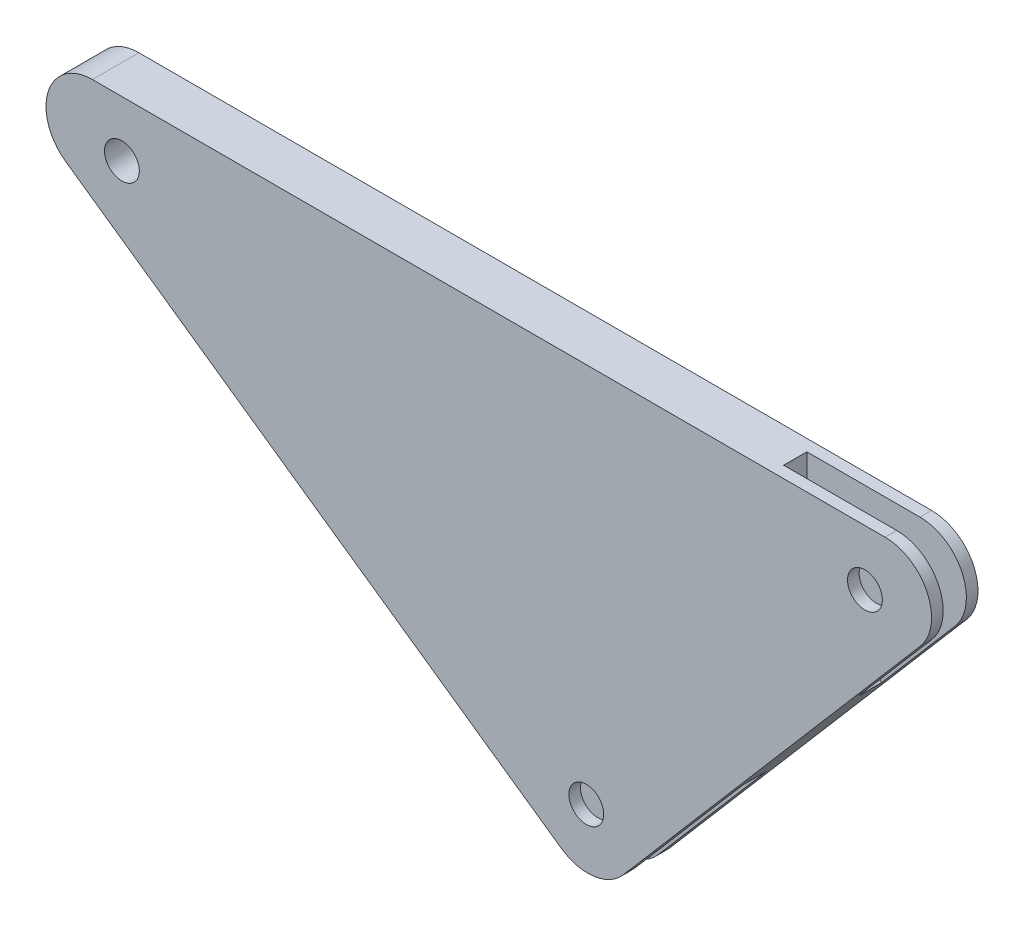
ISO-10303-21;
HEADER;
FILE_DESCRIPTION(('STEP AP214'),'2;1');
FILE_NAME('part.step','',(''),(''),'','','');
FILE_SCHEMA(('AUTOMOTIVE_DESIGN { 1 0 10303 214 1 1 1 1 }'));
ENDSEC;
DATA;
#1=APPLICATION_CONTEXT('core data for automotive mechanical design processes');
#2=APPLICATION_PROTOCOL_DEFINITION('international standard','automotive_design',2000,#1);
#3=PRODUCT_CONTEXT('',#1,'mechanical');
#4=PRODUCT('Part','Part','',(#3));
#5=PRODUCT_RELATED_PRODUCT_CATEGORY('part','',(#4));
#6=PRODUCT_DEFINITION_FORMATION('','',#4);
#7=PRODUCT_DEFINITION_CONTEXT('part definition',#1,'design');
#8=PRODUCT_DEFINITION('design','',#6,#7);
#9=PRODUCT_DEFINITION_SHAPE('','',#8);
#10=(LENGTH_UNIT() NAMED_UNIT(*) SI_UNIT(.MILLI.,.METRE.));
#11=(NAMED_UNIT(*) PLANE_ANGLE_UNIT() SI_UNIT($,.RADIAN.));
#12=(NAMED_UNIT(*) SI_UNIT($,.STERADIAN.) SOLID_ANGLE_UNIT());
#13=UNCERTAINTY_MEASURE_WITH_UNIT(LENGTH_MEASURE(1.E-05),#10,'distance_accuracy_value','');
#14=(GEOMETRIC_REPRESENTATION_CONTEXT(3) GLOBAL_UNCERTAINTY_ASSIGNED_CONTEXT((#13)) GLOBAL_UNIT_ASSIGNED_CONTEXT((#10,
#11,#12)) REPRESENTATION_CONTEXT('',''));
#15=CARTESIAN_POINT('',(0.,0.,0.));
#16=DIRECTION('',(0.,0.,1.));
#17=DIRECTION('',(1.,0.,0.));
#18=AXIS2_PLACEMENT_3D('',#15,#16,#17);
#19=CARTESIAN_POINT('',(417.445040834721,5.08,12.7));
#20=DIRECTION('',(0.,0.,-1.));
#21=DIRECTION('',(-1.,0.,0.));
#22=AXIS2_PLACEMENT_3D('',#19,#20,#21);
#23=CYLINDRICAL_SURFACE('',#22,25.4);
#24=CARTESIAN_POINT('',(417.445040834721,5.08,-6.35));
#25=DIRECTION('',(0.,0.,1.));
#26=DIRECTION('',(1.,0.,0.));
#27=AXIS2_PLACEMENT_3D('',#24,#25,#26);
#28=CIRCLE('',#27,25.4);
#29=CARTESIAN_POINT('',(436.7301585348,-11.4501008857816,-6.35));
#30=VERTEX_POINT('',#29);
#31=CARTESIAN_POINT('',(417.445040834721,30.48,-6.35));
#32=VERTEX_POINT('',#31);
#33=EDGE_CURVE('E157',#30,#32,#28,.T.);
#34=ORIENTED_EDGE('',*,*,#33,.F.);
#35=DIRECTION('',(0.,0.,-1.));
#36=VECTOR('',#35,1.);
#37=CARTESIAN_POINT('',(436.7301585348,-11.4501008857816,12.7));
#38=LINE('',#37,#36);
#39=CARTESIAN_POINT('',(436.7301585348,-11.4501008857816,-12.7));
#40=VERTEX_POINT('',#39);
#41=EDGE_CURVE('E249',#30,#40,#38,.T.);
#42=ORIENTED_EDGE('',*,*,#41,.T.);
#43=CARTESIAN_POINT('',(417.445040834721,5.08,-12.7));
#44=DIRECTION('',(0.,0.,1.));
#45=DIRECTION('',(-1.,0.,0.));
#46=AXIS2_PLACEMENT_3D('',#43,#44,#45);
#47=CIRCLE('',#46,25.4);
#48=CARTESIAN_POINT('',(417.445040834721,30.48,-12.7));
#49=VERTEX_POINT('',#48);
#50=EDGE_CURVE('E232',#40,#49,#47,.T.);
#51=ORIENTED_EDGE('',*,*,#50,.T.);
#52=DIRECTION('',(0.,0.,-1.));
#53=VECTOR('',#52,1.);
#54=CARTESIAN_POINT('',(417.445040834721,30.48,12.7));
#55=LINE('',#54,#53);
#56=EDGE_CURVE('E43',#32,#49,#55,.T.);
#57=ORIENTED_EDGE('',*,*,#56,.F.);
#58=EDGE_LOOP('',(#34,#42,#51,#57));
#59=FACE_BOUND('',#58,.T.);
#60=ADVANCED_FACE('F34',(#59),#23,.T.);
#61=CARTESIAN_POINT('',(417.445040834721,30.48,12.7));
#62=DIRECTION('',(0.,-1.,0.));
#63=DIRECTION('',(1.,0.,0.));
#64=AXIS2_PLACEMENT_3D('',#61,#62,#63);
#65=PLANE('',#64);
#66=DIRECTION('',(-1.,0.,0.));
#67=VECTOR('',#66,1.);
#68=CARTESIAN_POINT('',(417.445040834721,30.48,-6.35));
#69=LINE('',#68,#67);
#70=CARTESIAN_POINT('',(355.6,30.48,-6.35));
#71=VERTEX_POINT('',#70);
#72=EDGE_CURVE('E151',#32,#71,#69,.T.);
#73=ORIENTED_EDGE('',*,*,#72,.F.);
#74=ORIENTED_EDGE('',*,*,#56,.T.);
#75=DIRECTION('',(-1.,0.,0.));
#76=VECTOR('',#75,1.);
#77=CARTESIAN_POINT('',(417.445040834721,30.48,-12.7));
#78=LINE('',#77,#76);
#79=CARTESIAN_POINT('',(-16.1156146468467,30.4799999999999,-12.7));
#80=VERTEX_POINT('',#79);
#81=EDGE_CURVE('E252',#49,#80,#78,.T.);
#82=ORIENTED_EDGE('',*,*,#81,.T.);
#83=DIRECTION('',(0.,0.,-1.));
#84=VECTOR('',#83,1.);
#85=CARTESIAN_POINT('',(-16.1156146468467,30.4799999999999,12.7));
#86=LINE('',#85,#84);
#87=CARTESIAN_POINT('',(-16.1156146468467,30.4799999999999,12.7));
#88=VERTEX_POINT('',#87);
#89=EDGE_CURVE('E278',#88,#80,#86,.T.);
#90=ORIENTED_EDGE('',*,*,#89,.F.);
#91=DIRECTION('',(-1.,0.,0.));
#92=VECTOR('',#91,1.);
#93=CARTESIAN_POINT('',(417.445040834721,30.48,12.7));
#94=LINE('',#93,#92);
#95=CARTESIAN_POINT('',(417.445040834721,30.48,12.7));
#96=VERTEX_POINT('',#95);
#97=EDGE_CURVE('E238',#96,#88,#94,.T.);
#98=ORIENTED_EDGE('',*,*,#97,.F.);
#99=CARTESIAN_POINT('',(417.445040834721,30.48,6.35));
#100=VERTEX_POINT('',#99);
#101=EDGE_CURVE('E11',#96,#100,#55,.T.);
#102=ORIENTED_EDGE('',*,*,#101,.T.);
#103=DIRECTION('',(-1.,0.,0.));
#104=VECTOR('',#103,1.);
#105=CARTESIAN_POINT('',(417.445040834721,30.48,6.35));
#106=LINE('',#105,#104);
#107=CARTESIAN_POINT('',(355.6,30.48,6.35));
#108=VERTEX_POINT('',#107);
#109=EDGE_CURVE('E175',#100,#108,#106,.T.);
#110=ORIENTED_EDGE('',*,*,#109,.T.);
#111=DIRECTION('',(0.,0.,1.));
#112=VECTOR('',#111,1.);
#113=CARTESIAN_POINT('',(355.6,30.48,-6.35));
#114=LINE('',#113,#112);
#115=EDGE_CURVE('E166',#71,#108,#114,.T.);
#116=ORIENTED_EDGE('',*,*,#115,.F.);
#117=EDGE_LOOP('',(#73,#74,#82,#90,#98,#102,#110,#116));
#118=FACE_BOUND('',#117,.T.);
#119=ADVANCED_FACE('F174',(#118),#65,.F.);
#120=CARTESIAN_POINT('',(-30.6815581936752,-15.7284907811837,12.7));
#121=DIRECTION('',(0.573462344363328,0.81923192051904,0.));
#122=DIRECTION('',(-0.81923192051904,0.573462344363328,0.));
#123=AXIS2_PLACEMENT_3D('',#120,#121,#122);
#124=PLANE('',#123);
#125=DIRECTION('',(0.81923192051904,-0.573462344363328,0.));
#126=VECTOR('',#125,1.);
#127=CARTESIAN_POINT('',(-30.6815581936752,-15.7284907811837,-6.35));
#128=LINE('',#127,#126);
#129=CARTESIAN_POINT('',(135.528296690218,-132.075389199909,-6.35));
#130=VERTEX_POINT('',#129);
#131=CARTESIAN_POINT('',(240.293851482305,-205.41127755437,-6.35));
#132=VERTEX_POINT('',#131);
#133=EDGE_CURVE('E207',#130,#132,#128,.T.);
#134=ORIENTED_EDGE('',*,*,#133,.F.);
#135=DIRECTION('',(0.,0.,1.));
#136=VECTOR('',#135,1.);
#137=CARTESIAN_POINT('',(135.528296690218,-132.075389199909,-6.35));
#138=LINE('',#137,#136);
#139=CARTESIAN_POINT('',(135.528296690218,-132.075389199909,6.35));
#140=VERTEX_POINT('',#139);
#141=EDGE_CURVE('E187',#130,#140,#138,.T.);
#142=ORIENTED_EDGE('',*,*,#141,.T.);
#143=DIRECTION('',(0.81923192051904,-0.573462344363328,0.));
#144=VECTOR('',#143,1.);
#145=CARTESIAN_POINT('',(-30.6815581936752,-15.7284907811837,6.35));
#146=LINE('',#145,#144);
#147=CARTESIAN_POINT('',(240.293851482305,-205.41127755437,6.35));
#148=VERTEX_POINT('',#147);
#149=EDGE_CURVE('E199',#140,#148,#146,.T.);
#150=ORIENTED_EDGE('',*,*,#149,.T.);
#151=DIRECTION('',(0.,0.,-1.));
#152=VECTOR('',#151,1.);
#153=CARTESIAN_POINT('',(240.293851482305,-205.41127755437,12.7));
#154=LINE('',#153,#152);
#155=CARTESIAN_POINT('',(240.293851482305,-205.41127755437,12.7));
#156=VERTEX_POINT('',#155);
#157=EDGE_CURVE('E272',#156,#148,#154,.T.);
#158=ORIENTED_EDGE('',*,*,#157,.F.);
#159=DIRECTION('',(0.81923192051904,-0.573462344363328,0.));
#160=VECTOR('',#159,1.);
#161=CARTESIAN_POINT('',(-30.6815581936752,-15.7284907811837,12.7));
#162=LINE('',#161,#160);
#163=CARTESIAN_POINT('',(-30.6815581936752,-15.7284907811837,12.7));
#164=VERTEX_POINT('',#163);
#165=EDGE_CURVE('E243',#164,#156,#162,.T.);
#166=ORIENTED_EDGE('',*,*,#165,.F.);
#167=DIRECTION('',(0.,0.,-1.));
#168=VECTOR('',#167,1.);
#169=CARTESIAN_POINT('',(-30.6815581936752,-15.7284907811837,12.7));
#170=LINE('',#169,#168);
#171=CARTESIAN_POINT('',(-30.6815581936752,-15.7284907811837,-12.7));
#172=VERTEX_POINT('',#171);
#173=EDGE_CURVE('E275',#164,#172,#170,.T.);
#174=ORIENTED_EDGE('',*,*,#173,.T.);
#175=DIRECTION('',(0.81923192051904,-0.573462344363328,0.));
#176=VECTOR('',#175,1.);
#177=CARTESIAN_POINT('',(-30.6815581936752,-15.7284907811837,-12.7));
#178=LINE('',#177,#176);
#179=CARTESIAN_POINT('',(240.293851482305,-205.41127755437,-12.7));
#180=VERTEX_POINT('',#179);
#181=EDGE_CURVE('E256',#172,#180,#178,.T.);
#182=ORIENTED_EDGE('',*,*,#181,.T.);
#183=EDGE_CURVE('E271',#132,#180,#154,.T.);
#184=ORIENTED_EDGE('',*,*,#183,.F.);
#185=EDGE_LOOP('',(#134,#142,#150,#158,#166,#174,#182,#184));
#186=FACE_BOUND('',#185,.T.);
#187=ADVANCED_FACE('F327',(#186),#124,.F.);
#188=CARTESIAN_POINT('',(254.859795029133,-184.602786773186,12.7));
#189=DIRECTION('',(0.,0.,-1.));
#190=DIRECTION('',(-1.,0.,0.));
#191=AXIS2_PLACEMENT_3D('',#188,#189,#190);
#192=CYLINDRICAL_SURFACE('',#191,25.4);
#193=CARTESIAN_POINT('',(254.859795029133,-184.602786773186,-6.35));
#194=DIRECTION('',(0.,0.,1.));
#195=DIRECTION('',(1.,0.,0.));
#196=AXIS2_PLACEMENT_3D('',#193,#194,#195);
#197=CIRCLE('',#196,25.4);
#198=CARTESIAN_POINT('',(274.144912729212,-201.132887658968,-6.35));
#199=VERTEX_POINT('',#198);
#200=EDGE_CURVE('E205',#132,#199,#197,.T.);
#201=ORIENTED_EDGE('',*,*,#200,.F.);
#202=ORIENTED_EDGE('',*,*,#183,.T.);
#203=CARTESIAN_POINT('',(254.859795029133,-184.602786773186,-12.7));
#204=DIRECTION('',(0.,0.,1.));
#205=DIRECTION('',(1.,0.,0.));
#206=AXIS2_PLACEMENT_3D('',#203,#204,#205);
#207=CIRCLE('',#206,25.4);
#208=CARTESIAN_POINT('',(274.144912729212,-201.132887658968,-12.7));
#209=VERTEX_POINT('',#208);
#210=EDGE_CURVE('E259',#180,#209,#207,.T.);
#211=ORIENTED_EDGE('',*,*,#210,.T.);
#212=DIRECTION('',(0.,0.,-1.));
#213=VECTOR('',#212,1.);
#214=CARTESIAN_POINT('',(274.144912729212,-201.132887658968,12.7));
#215=LINE('',#214,#213);
#216=EDGE_CURVE('E267',#199,#209,#215,.T.);
#217=ORIENTED_EDGE('',*,*,#216,.F.);
#218=EDGE_LOOP('',(#201,#202,#211,#217));
#219=FACE_BOUND('',#218,.T.);
#220=ADVANCED_FACE('F394',(#219),#192,.T.);
#221=CARTESIAN_POINT('',(274.144912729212,-201.132887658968,12.7));
#222=DIRECTION('',(-0.759256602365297,0.650791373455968,0.));
#223=DIRECTION('',(-0.650791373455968,-0.759256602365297,0.));
#224=AXIS2_PLACEMENT_3D('',#221,#222,#223);
#225=PLANE('',#224);
#226=DIRECTION('',(0.650791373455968,0.759256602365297,0.));
#227=VECTOR('',#226,1.);
#228=CARTESIAN_POINT('',(274.144912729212,-201.132887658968,-6.35));
#229=LINE('',#228,#227);
#230=CARTESIAN_POINT('',(396.481939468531,-58.406356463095,-6.35));
#231=VERTEX_POINT('',#230);
#232=EDGE_CURVE('E214',#231,#30,#229,.T.);
#233=ORIENTED_EDGE('',*,*,#232,.F.);
#234=DIRECTION('',(0.,0.,1.));
#235=VECTOR('',#234,1.);
#236=CARTESIAN_POINT('',(396.481939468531,-58.406356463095,-6.35));
#237=LINE('',#236,#235);
#238=CARTESIAN_POINT('',(396.481939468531,-58.406356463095,6.35));
#239=VERTEX_POINT('',#238);
#240=EDGE_CURVE('E283',#231,#239,#237,.T.);
#241=ORIENTED_EDGE('',*,*,#240,.T.);
#242=DIRECTION('',(0.650791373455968,0.759256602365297,0.));
#243=VECTOR('',#242,1.);
#244=CARTESIAN_POINT('',(274.144912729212,-201.132887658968,6.35));
#245=LINE('',#244,#243);
#246=CARTESIAN_POINT('',(436.7301585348,-11.4501008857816,6.35));
#247=VERTEX_POINT('',#246);
#248=EDGE_CURVE('E210',#239,#247,#245,.T.);
#249=ORIENTED_EDGE('',*,*,#248,.T.);
#250=CARTESIAN_POINT('',(436.7301585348,-11.4501008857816,12.7));
#251=VERTEX_POINT('',#250);
#252=EDGE_CURVE('E264',#251,#247,#38,.T.);
#253=ORIENTED_EDGE('',*,*,#252,.F.);
#254=DIRECTION('',(0.650791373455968,0.759256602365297,0.));
#255=VECTOR('',#254,1.);
#256=CARTESIAN_POINT('',(274.144912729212,-201.132887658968,12.7));
#257=LINE('',#256,#255);
#258=CARTESIAN_POINT('',(274.144912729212,-201.132887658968,12.7));
#259=VERTEX_POINT('',#258);
#260=EDGE_CURVE('E247',#259,#251,#257,.T.);
#261=ORIENTED_EDGE('',*,*,#260,.F.);
#262=CARTESIAN_POINT('',(274.144912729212,-201.132887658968,6.35));
#263=VERTEX_POINT('',#262);
#264=EDGE_CURVE('E268',#259,#263,#215,.T.);
#265=ORIENTED_EDGE('',*,*,#264,.T.);
#266=DIRECTION('',(0.650791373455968,0.759256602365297,0.));
#267=VECTOR('',#266,1.);
#268=CARTESIAN_POINT('',(274.144912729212,-201.132887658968,6.35));
#269=LINE('',#268,#267);
#270=CARTESIAN_POINT('',(333.337054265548,-132.075389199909,6.35));
#271=VERTEX_POINT('',#270);
#272=EDGE_CURVE('E192',#263,#271,#269,.T.);
#273=ORIENTED_EDGE('',*,*,#272,.T.);
#274=DIRECTION('',(0.,0.,1.));
#275=VECTOR('',#274,1.);
#276=CARTESIAN_POINT('',(333.337054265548,-132.075389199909,-6.35));
#277=LINE('',#276,#275);
#278=CARTESIAN_POINT('',(333.337054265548,-132.075389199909,-6.35));
#279=VERTEX_POINT('',#278);
#280=EDGE_CURVE('E51',#279,#271,#277,.T.);
#281=ORIENTED_EDGE('',*,*,#280,.F.);
#282=DIRECTION('',(0.650791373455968,0.759256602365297,0.));
#283=VECTOR('',#282,1.);
#284=CARTESIAN_POINT('',(274.144912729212,-201.132887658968,-6.35));
#285=LINE('',#284,#283);
#286=EDGE_CURVE('E203',#199,#279,#285,.T.);
#287=ORIENTED_EDGE('',*,*,#286,.F.);
#288=ORIENTED_EDGE('',*,*,#216,.T.);
#289=DIRECTION('',(0.650791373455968,0.759256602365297,0.));
#290=VECTOR('',#289,1.);
#291=CARTESIAN_POINT('',(274.144912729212,-201.132887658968,-12.7));
#292=LINE('',#291,#290);
#293=EDGE_CURVE('E239',#209,#40,#292,.T.);
#294=ORIENTED_EDGE('',*,*,#293,.T.);
#295=ORIENTED_EDGE('',*,*,#41,.F.);
#296=EDGE_LOOP('',(#233,#241,#249,#253,#261,#265,#273,#281,#287,#288,#294,#295));
#297=FACE_BOUND('',#296,.T.);
#298=ADVANCED_FACE('F346',(#297),#225,.F.);
#299=CARTESIAN_POINT('',(406.4,0.,12.7));
#300=DIRECTION('',(0.,0.,-1.));
#301=DIRECTION('',(-1.,0.,0.));
#302=AXIS2_PLACEMENT_3D('',#299,#300,#301);
#303=CYLINDRICAL_SURFACE('',#302,9.52500000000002);
#304=CARTESIAN_POINT('',(406.4,0.,-12.7));
#305=DIRECTION('',(0.,0.,1.));
#306=DIRECTION('',(1.,0.,0.));
#307=AXIS2_PLACEMENT_3D('',#304,#305,#306);
#308=CIRCLE('',#307,9.52500000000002);
#309=CARTESIAN_POINT('',(415.925,0.,-12.7));
#310=VERTEX_POINT('',#309);
#311=EDGE_CURVE('E220',#310,#310,#308,.T.);
#312=ORIENTED_EDGE('',*,*,#311,.F.);
#313=EDGE_LOOP('',(#312));
#314=FACE_BOUND('',#313,.T.);
#315=CARTESIAN_POINT('',(406.4,0.,-6.35));
#316=DIRECTION('',(0.,0.,1.));
#317=DIRECTION('',(1.,0.,0.));
#318=AXIS2_PLACEMENT_3D('',#315,#316,#317);
#319=CIRCLE('',#318,9.52500000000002);
#320=CARTESIAN_POINT('',(415.925,0.,-6.35));
#321=VERTEX_POINT('',#320);
#322=EDGE_CURVE('E38',#321,#321,#319,.T.);
#323=ORIENTED_EDGE('',*,*,#322,.T.);
#324=EDGE_LOOP('',(#323));
#325=FACE_BOUND('',#324,.T.);
#326=ADVANCED_FACE('F296',(#314,#325),#303,.F.);
#327=CARTESIAN_POINT('',(254.,-177.8,12.7));
#328=DIRECTION('',(0.,0.,-1.));
#329=DIRECTION('',(-1.,0.,0.));
#330=AXIS2_PLACEMENT_3D('',#327,#328,#329);
#331=CYLINDRICAL_SURFACE('',#330,9.52500000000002);
#332=CARTESIAN_POINT('',(254.,-177.8,-12.7));
#333=DIRECTION('',(0.,0.,1.));
#334=DIRECTION('',(1.,0.,0.));
#335=AXIS2_PLACEMENT_3D('',#332,#333,#334);
#336=CIRCLE('',#335,9.52500000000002);
#337=CARTESIAN_POINT('',(263.525,-177.8,-12.7));
#338=VERTEX_POINT('',#337);
#339=EDGE_CURVE('E161',#338,#338,#336,.T.);
#340=ORIENTED_EDGE('',*,*,#339,.F.);
#341=EDGE_LOOP('',(#340));
#342=FACE_BOUND('',#341,.T.);
#343=CARTESIAN_POINT('',(254.,-177.8,-6.35));
#344=DIRECTION('',(0.,0.,1.));
#345=DIRECTION('',(1.,0.,0.));
#346=AXIS2_PLACEMENT_3D('',#343,#344,#345);
#347=CIRCLE('',#346,9.52500000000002);
#348=CARTESIAN_POINT('',(263.525,-177.8,-6.35));
#349=VERTEX_POINT('',#348);
#350=EDGE_CURVE('E202',#349,#349,#347,.T.);
#351=ORIENTED_EDGE('',*,*,#350,.T.);
#352=EDGE_LOOP('',(#351));
#353=FACE_BOUND('',#352,.T.);
#354=ADVANCED_FACE('F303',(#342,#353),#331,.F.);
#355=CARTESIAN_POINT('',(417.445040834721,5.08,12.7));
#356=DIRECTION('',(0.,0.,-1.));
#357=DIRECTION('',(-1.,0.,0.));
#358=AXIS2_PLACEMENT_3D('',#355,#356,#357);
#359=PLANE('',#358);
#360=CARTESIAN_POINT('',(417.445040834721,5.08,12.7));
#361=DIRECTION('',(0.,0.,1.));
#362=DIRECTION('',(-1.,0.,0.));
#363=AXIS2_PLACEMENT_3D('',#360,#361,#362);
#364=CIRCLE('',#363,25.4);
#365=EDGE_CURVE('E235',#251,#96,#364,.T.);
#366=ORIENTED_EDGE('',*,*,#365,.T.);
#367=ORIENTED_EDGE('',*,*,#97,.T.);
#368=CARTESIAN_POINT('',(-16.1156146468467,5.07999999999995,12.7));
#369=DIRECTION('',(0.,0.,1.));
#370=DIRECTION('',(1.,0.,0.));
#371=AXIS2_PLACEMENT_3D('',#368,#369,#370);
#372=CIRCLE('',#371,25.4);
#373=EDGE_CURVE('E241',#88,#164,#372,.T.);
#374=ORIENTED_EDGE('',*,*,#373,.T.);
#375=ORIENTED_EDGE('',*,*,#165,.T.);
#376=CARTESIAN_POINT('',(254.859795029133,-184.602786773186,12.7));
#377=DIRECTION('',(0.,0.,1.));
#378=DIRECTION('',(1.,0.,0.));
#379=AXIS2_PLACEMENT_3D('',#376,#377,#378);
#380=CIRCLE('',#379,25.4);
#381=EDGE_CURVE('E245',#156,#259,#380,.T.);
#382=ORIENTED_EDGE('',*,*,#381,.T.);
#383=ORIENTED_EDGE('',*,*,#260,.T.);
#384=EDGE_LOOP('',(#366,#367,#374,#375,#382,#383));
#385=FACE_BOUND('',#384,.T.);
#386=CARTESIAN_POINT('',(0.,0.,12.7));
#387=DIRECTION('',(0.,0.,1.));
#388=DIRECTION('',(1.,0.,0.));
#389=AXIS2_PLACEMENT_3D('',#386,#387,#388);
#390=CIRCLE('',#389,9.525);
#391=CARTESIAN_POINT('',(9.525,0.,12.7));
#392=VERTEX_POINT('',#391);
#393=EDGE_CURVE('E229',#392,#392,#390,.T.);
#394=ORIENTED_EDGE('',*,*,#393,.F.);
#395=EDGE_LOOP('',(#394));
#396=FACE_BOUND('',#395,.T.);
#397=CARTESIAN_POINT('',(406.4,0.,12.7));
#398=DIRECTION('',(0.,0.,1.));
#399=DIRECTION('',(1.,0.,0.));
#400=AXIS2_PLACEMENT_3D('',#397,#398,#399);
#401=CIRCLE('',#400,9.52500000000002);
#402=CARTESIAN_POINT('',(415.925,0.,12.7));
#403=VERTEX_POINT('',#402);
#404=EDGE_CURVE('E223',#403,#403,#401,.T.);
#405=ORIENTED_EDGE('',*,*,#404,.F.);
#406=EDGE_LOOP('',(#405));
#407=FACE_BOUND('',#406,.T.);
#408=CARTESIAN_POINT('',(254.,-177.8,12.7));
#409=DIRECTION('',(0.,0.,1.));
#410=DIRECTION('',(1.,0.,0.));
#411=AXIS2_PLACEMENT_3D('',#408,#409,#410);
#412=CIRCLE('',#411,9.52500000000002);
#413=CARTESIAN_POINT('',(263.525,-177.8,12.7));
#414=VERTEX_POINT('',#413);
#415=EDGE_CURVE('E217',#414,#414,#412,.T.);
#416=ORIENTED_EDGE('',*,*,#415,.F.);
#417=EDGE_LOOP('',(#416));
#418=FACE_BOUND('',#417,.T.);
#419=ADVANCED_FACE('F299',(#385,#396,#407,#418),#359,.F.);
#420=CARTESIAN_POINT('',(417.445040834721,5.08,-12.7));
#421=DIRECTION('',(0.,0.,-1.));
#422=DIRECTION('',(-1.,0.,0.));
#423=AXIS2_PLACEMENT_3D('',#420,#421,#422);
#424=PLANE('',#423);
#425=ORIENTED_EDGE('',*,*,#311,.T.);
#426=EDGE_LOOP('',(#425));
#427=FACE_BOUND('',#426,.T.);
#428=ORIENTED_EDGE('',*,*,#50,.F.);
#429=ORIENTED_EDGE('',*,*,#293,.F.);
#430=ORIENTED_EDGE('',*,*,#210,.F.);
#431=ORIENTED_EDGE('',*,*,#181,.F.);
#432=CARTESIAN_POINT('',(-16.1156146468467,5.07999999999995,-12.7));
#433=DIRECTION('',(0.,0.,1.));
#434=DIRECTION('',(1.,0.,0.));
#435=AXIS2_PLACEMENT_3D('',#432,#433,#434);
#436=CIRCLE('',#435,25.4);
#437=EDGE_CURVE('E254',#80,#172,#436,.T.);
#438=ORIENTED_EDGE('',*,*,#437,.F.);
#439=ORIENTED_EDGE('',*,*,#81,.F.);
#440=EDGE_LOOP('',(#428,#429,#430,#431,#438,#439));
#441=FACE_BOUND('',#440,.T.);
#442=CARTESIAN_POINT('',(0.,0.,-12.7));
#443=DIRECTION('',(0.,0.,1.));
#444=DIRECTION('',(1.,0.,0.));
#445=AXIS2_PLACEMENT_3D('',#442,#443,#444);
#446=CIRCLE('',#445,9.525);
#447=CARTESIAN_POINT('',(9.525,0.,-12.7));
#448=VERTEX_POINT('',#447);
#449=EDGE_CURVE('E226',#448,#448,#446,.T.);
#450=ORIENTED_EDGE('',*,*,#449,.T.);
#451=EDGE_LOOP('',(#450));
#452=FACE_BOUND('',#451,.T.);
#453=ORIENTED_EDGE('',*,*,#339,.T.);
#454=EDGE_LOOP('',(#453));
#455=FACE_BOUND('',#454,.T.);
#456=ADVANCED_FACE('F302',(#427,#441,#452,#455),#424,.T.);
#457=ORIENTED_EDGE('',*,*,#252,.T.);
#458=CARTESIAN_POINT('',(417.445040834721,5.08,6.35));
#459=DIRECTION('',(0.,0.,1.));
#460=DIRECTION('',(1.,0.,0.));
#461=AXIS2_PLACEMENT_3D('',#458,#459,#460);
#462=CIRCLE('',#461,25.4);
#463=EDGE_CURVE('E59',#247,#100,#462,.T.);
#464=ORIENTED_EDGE('',*,*,#463,.T.);
#465=ORIENTED_EDGE('',*,*,#101,.F.);
#466=ORIENTED_EDGE('',*,*,#365,.F.);
#467=EDGE_LOOP('',(#457,#464,#465,#466));
#468=FACE_BOUND('',#467,.T.);
#469=ADVANCED_FACE('F36',(#468),#23,.T.);
#470=CARTESIAN_POINT('',(-16.1156146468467,5.07999999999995,12.7));
#471=DIRECTION('',(0.,0.,-1.));
#472=DIRECTION('',(-1.,0.,0.));
#473=AXIS2_PLACEMENT_3D('',#470,#471,#472);
#474=CYLINDRICAL_SURFACE('',#473,25.4);
#475=ORIENTED_EDGE('',*,*,#437,.T.);
#476=ORIENTED_EDGE('',*,*,#173,.F.);
#477=ORIENTED_EDGE('',*,*,#373,.F.);
#478=ORIENTED_EDGE('',*,*,#89,.T.);
#479=EDGE_LOOP('',(#475,#476,#477,#478));
#480=FACE_BOUND('',#479,.T.);
#481=ADVANCED_FACE('F329',(#480),#474,.T.);
#482=ORIENTED_EDGE('',*,*,#157,.T.);
#483=CARTESIAN_POINT('',(254.859795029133,-184.602786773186,6.35));
#484=DIRECTION('',(0.,0.,1.));
#485=DIRECTION('',(1.,0.,0.));
#486=AXIS2_PLACEMENT_3D('',#483,#484,#485);
#487=CIRCLE('',#486,25.4);
#488=EDGE_CURVE('E195',#148,#263,#487,.T.);
#489=ORIENTED_EDGE('',*,*,#488,.T.);
#490=ORIENTED_EDGE('',*,*,#264,.F.);
#491=ORIENTED_EDGE('',*,*,#381,.F.);
#492=EDGE_LOOP('',(#482,#489,#490,#491));
#493=FACE_BOUND('',#492,.T.);
#494=ADVANCED_FACE('F335',(#493),#192,.T.);
#495=CARTESIAN_POINT('',(0.,0.,12.7));
#496=DIRECTION('',(0.,0.,-1.));
#497=DIRECTION('',(-1.,0.,0.));
#498=AXIS2_PLACEMENT_3D('',#495,#496,#497);
#499=CYLINDRICAL_SURFACE('',#498,9.525);
#500=ORIENTED_EDGE('',*,*,#393,.T.);
#501=EDGE_LOOP('',(#500));
#502=FACE_BOUND('',#501,.T.);
#503=ORIENTED_EDGE('',*,*,#449,.F.);
#504=EDGE_LOOP('',(#503));
#505=FACE_BOUND('',#504,.T.);
#506=ADVANCED_FACE('F294',(#502,#505),#499,.F.);
#507=CARTESIAN_POINT('',(406.4,0.,6.35));
#508=DIRECTION('',(0.,0.,1.));
#509=DIRECTION('',(1.,0.,0.));
#510=AXIS2_PLACEMENT_3D('',#507,#508,#509);
#511=CIRCLE('',#510,9.52500000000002);
#512=CARTESIAN_POINT('',(415.925,0.,6.35));
#513=VERTEX_POINT('',#512);
#514=EDGE_CURVE('E209',#513,#513,#511,.T.);
#515=ORIENTED_EDGE('',*,*,#514,.F.);
#516=EDGE_LOOP('',(#515));
#517=FACE_BOUND('',#516,.T.);
#518=ORIENTED_EDGE('',*,*,#404,.T.);
#519=EDGE_LOOP('',(#518));
#520=FACE_BOUND('',#519,.T.);
#521=ADVANCED_FACE('F290',(#517,#520),#303,.F.);
#522=CARTESIAN_POINT('',(254.,-177.8,6.35));
#523=DIRECTION('',(0.,0.,1.));
#524=DIRECTION('',(1.,0.,0.));
#525=AXIS2_PLACEMENT_3D('',#522,#523,#524);
#526=CIRCLE('',#525,9.52500000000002);
#527=CARTESIAN_POINT('',(263.525,-177.8,6.35));
#528=VERTEX_POINT('',#527);
#529=EDGE_CURVE('E196',#528,#528,#526,.T.);
#530=ORIENTED_EDGE('',*,*,#529,.F.);
#531=EDGE_LOOP('',(#530));
#532=FACE_BOUND('',#531,.T.);
#533=ORIENTED_EDGE('',*,*,#415,.T.);
#534=EDGE_LOOP('',(#533));
#535=FACE_BOUND('',#534,.T.);
#536=ADVANCED_FACE('F293',(#532,#535),#331,.F.);
#537=CARTESIAN_POINT('',(0.,0.,-6.35));
#538=DIRECTION('',(0.,0.,1.));
#539=DIRECTION('',(1.,0.,0.));
#540=AXIS2_PLACEMENT_3D('',#537,#538,#539);
#541=PLANE('',#540);
#542=ORIENTED_EDGE('',*,*,#350,.F.);
#543=EDGE_LOOP('',(#542));
#544=FACE_BOUND('',#543,.T.);
#545=ORIENTED_EDGE('',*,*,#133,.T.);
#546=ORIENTED_EDGE('',*,*,#200,.T.);
#547=ORIENTED_EDGE('',*,*,#286,.T.);
#548=DIRECTION('',(1.,0.,0.));
#549=VECTOR('',#548,1.);
#550=CARTESIAN_POINT('',(0.,-132.075389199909,-6.35));
#551=LINE('',#550,#549);
#552=EDGE_CURVE('E183',#130,#279,#551,.T.);
#553=ORIENTED_EDGE('',*,*,#552,.F.);
#554=EDGE_LOOP('',(#545,#546,#547,#553));
#555=FACE_BOUND('',#554,.T.);
#556=ADVANCED_FACE('F309',(#544,#555),#541,.T.);
#557=CARTESIAN_POINT('',(0.,0.,6.35));
#558=DIRECTION('',(0.,0.,1.));
#559=DIRECTION('',(1.,0.,0.));
#560=AXIS2_PLACEMENT_3D('',#557,#558,#559);
#561=PLANE('',#560);
#562=ORIENTED_EDGE('',*,*,#529,.T.);
#563=EDGE_LOOP('',(#562));
#564=FACE_BOUND('',#563,.T.);
#565=DIRECTION('',(1.,0.,0.));
#566=VECTOR('',#565,1.);
#567=CARTESIAN_POINT('',(0.,-132.075389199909,6.35));
#568=LINE('',#567,#566);
#569=EDGE_CURVE('E185',#140,#271,#568,.T.);
#570=ORIENTED_EDGE('',*,*,#569,.T.);
#571=ORIENTED_EDGE('',*,*,#272,.F.);
#572=ORIENTED_EDGE('',*,*,#488,.F.);
#573=ORIENTED_EDGE('',*,*,#149,.F.);
#574=EDGE_LOOP('',(#570,#571,#572,#573));
#575=FACE_BOUND('',#574,.T.);
#576=ADVANCED_FACE('F315',(#564,#575),#561,.F.);
#577=CARTESIAN_POINT('',(0.,-132.075389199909,-6.35));
#578=DIRECTION('',(0.,-1.,0.));
#579=DIRECTION('',(0.,0.,-1.));
#580=AXIS2_PLACEMENT_3D('',#577,#578,#579);
#581=PLANE('',#580);
#582=ORIENTED_EDGE('',*,*,#569,.F.);
#583=ORIENTED_EDGE('',*,*,#141,.F.);
#584=ORIENTED_EDGE('',*,*,#552,.T.);
#585=ORIENTED_EDGE('',*,*,#280,.T.);
#586=EDGE_LOOP('',(#582,#583,#584,#585));
#587=FACE_BOUND('',#586,.T.);
#588=ADVANCED_FACE('F375',(#587),#581,.T.);
#589=CARTESIAN_POINT('',(0.,0.,-6.35));
#590=DIRECTION('',(0.,0.,1.));
#591=DIRECTION('',(1.,0.,0.));
#592=AXIS2_PLACEMENT_3D('',#589,#590,#591);
#593=PLANE('',#592);
#594=ORIENTED_EDGE('',*,*,#322,.F.);
#595=EDGE_LOOP('',(#594));
#596=FACE_BOUND('',#595,.T.);
#597=ORIENTED_EDGE('',*,*,#72,.T.);
#598=DIRECTION('',(0.,-1.,0.));
#599=VECTOR('',#598,1.);
#600=CARTESIAN_POINT('',(355.6,-6.47630097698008E-13,-6.35));
#601=LINE('',#600,#599);
#602=CARTESIAN_POINT('',(355.6,0.,-6.35));
#603=VERTEX_POINT('',#602);
#604=EDGE_CURVE('E155',#71,#603,#601,.T.);
#605=ORIENTED_EDGE('',*,*,#604,.T.);
#606=CARTESIAN_POINT('',(406.4,0.,-6.35));
#607=DIRECTION('',(0.,0.,1.));
#608=DIRECTION('',(1.,0.,0.));
#609=AXIS2_PLACEMENT_3D('',#606,#607,#608);
#610=CIRCLE('',#609,50.8);
#611=CARTESIAN_POINT('',(373.339798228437,-38.5702354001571,-6.35));
#612=VERTEX_POINT('',#611);
#613=EDGE_CURVE('E170',#603,#612,#610,.T.);
#614=ORIENTED_EDGE('',*,*,#613,.T.);
#615=DIRECTION('',(-0.759256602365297,0.650791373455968,0.));
#616=VECTOR('',#615,1.);
#617=CARTESIAN_POINT('',(139.062151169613,162.239176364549,-6.35));
#618=LINE('',#617,#616);
#619=EDGE_CURVE('E176',#231,#612,#618,.T.);
#620=ORIENTED_EDGE('',*,*,#619,.F.);
#621=ORIENTED_EDGE('',*,*,#232,.T.);
#622=ORIENTED_EDGE('',*,*,#33,.T.);
#623=EDGE_LOOP('',(#597,#605,#614,#620,#621,#622));
#624=FACE_BOUND('',#623,.T.);
#625=ADVANCED_FACE('F153',(#596,#624),#593,.T.);
#626=CARTESIAN_POINT('',(0.,0.,6.35));
#627=DIRECTION('',(0.,0.,1.));
#628=DIRECTION('',(1.,0.,0.));
#629=AXIS2_PLACEMENT_3D('',#626,#627,#628);
#630=PLANE('',#629);
#631=ORIENTED_EDGE('',*,*,#514,.T.);
#632=EDGE_LOOP('',(#631));
#633=FACE_BOUND('',#632,.T.);
#634=ORIENTED_EDGE('',*,*,#463,.F.);
#635=ORIENTED_EDGE('',*,*,#248,.F.);
#636=DIRECTION('',(-0.759256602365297,0.650791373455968,0.));
#637=VECTOR('',#636,1.);
#638=CARTESIAN_POINT('',(139.062151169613,162.239176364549,6.35));
#639=LINE('',#638,#637);
#640=CARTESIAN_POINT('',(373.339798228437,-38.5702354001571,6.35));
#641=VERTEX_POINT('',#640);
#642=EDGE_CURVE('E171',#239,#641,#639,.T.);
#643=ORIENTED_EDGE('',*,*,#642,.T.);
#644=CARTESIAN_POINT('',(406.4,0.,6.35));
#645=DIRECTION('',(0.,0.,1.));
#646=DIRECTION('',(1.,0.,0.));
#647=AXIS2_PLACEMENT_3D('',#644,#645,#646);
#648=CIRCLE('',#647,50.8);
#649=CARTESIAN_POINT('',(355.6,0.,6.35));
#650=VERTEX_POINT('',#649);
#651=EDGE_CURVE('E356',#650,#641,#648,.T.);
#652=ORIENTED_EDGE('',*,*,#651,.F.);
#653=DIRECTION('',(0.,-1.,0.));
#654=VECTOR('',#653,1.);
#655=CARTESIAN_POINT('',(355.6,-6.47630097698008E-13,6.35));
#656=LINE('',#655,#654);
#657=EDGE_CURVE('E190',#108,#650,#656,.T.);
#658=ORIENTED_EDGE('',*,*,#657,.F.);
#659=ORIENTED_EDGE('',*,*,#109,.F.);
#660=EDGE_LOOP('',(#634,#635,#643,#652,#658,#659));
#661=FACE_BOUND('',#660,.T.);
#662=ADVANCED_FACE('F288',(#633,#661),#630,.F.);
#663=CARTESIAN_POINT('',(139.062151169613,162.239176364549,-6.35));
#664=DIRECTION('',(0.650791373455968,0.759256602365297,0.));
#665=DIRECTION('',(-0.759256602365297,0.650791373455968,0.));
#666=AXIS2_PLACEMENT_3D('',#663,#664,#665);
#667=PLANE('',#666);
#668=ORIENTED_EDGE('',*,*,#642,.F.);
#669=ORIENTED_EDGE('',*,*,#240,.F.);
#670=ORIENTED_EDGE('',*,*,#619,.T.);
#671=DIRECTION('',(0.,0.,1.));
#672=VECTOR('',#671,1.);
#673=CARTESIAN_POINT('',(373.339798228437,-38.5702354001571,-6.35));
#674=LINE('',#673,#672);
#675=EDGE_CURVE('E178',#612,#641,#674,.T.);
#676=ORIENTED_EDGE('',*,*,#675,.T.);
#677=EDGE_LOOP('',(#668,#669,#670,#676));
#678=FACE_BOUND('',#677,.T.);
#679=ADVANCED_FACE('F353',(#678),#667,.T.);
#680=CARTESIAN_POINT('',(406.4,0.,-6.35));
#681=DIRECTION('',(0.,0.,1.));
#682=DIRECTION('',(1.,0.,0.));
#683=AXIS2_PLACEMENT_3D('',#680,#681,#682);
#684=CYLINDRICAL_SURFACE('',#683,50.8);
#685=ORIENTED_EDGE('',*,*,#651,.T.);
#686=ORIENTED_EDGE('',*,*,#675,.F.);
#687=ORIENTED_EDGE('',*,*,#613,.F.);
#688=DIRECTION('',(0.,0.,1.));
#689=VECTOR('',#688,1.);
#690=CARTESIAN_POINT('',(355.6,0.,-6.35));
#691=LINE('',#690,#689);
#692=EDGE_CURVE('E168',#603,#650,#691,.T.);
#693=ORIENTED_EDGE('',*,*,#692,.T.);
#694=EDGE_LOOP('',(#685,#686,#687,#693));
#695=FACE_BOUND('',#694,.T.);
#696=ADVANCED_FACE('F363',(#695),#684,.F.);
#697=CARTESIAN_POINT('',(355.6,-6.47630097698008E-13,-6.35));
#698=DIRECTION('',(-1.,0.,0.));
#699=DIRECTION('',(0.,-1.,0.));
#700=AXIS2_PLACEMENT_3D('',#697,#698,#699);
#701=PLANE('',#700);
#702=ORIENTED_EDGE('',*,*,#657,.T.);
#703=ORIENTED_EDGE('',*,*,#692,.F.);
#704=ORIENTED_EDGE('',*,*,#604,.F.);
#705=ORIENTED_EDGE('',*,*,#115,.T.);
#706=EDGE_LOOP('',(#702,#703,#704,#705));
#707=FACE_BOUND('',#706,.T.);
#708=ADVANCED_FACE('F165',(#707),#701,.F.);
#709=CLOSED_SHELL('',(#60,#119,#187,#220,#298,#326,#354,#419,#456,#469,#481,#494,#506,#521,#536,
#556,#576,#588,#625,#662,#679,#696,#708));
#710=MANIFOLD_SOLID_BREP('B2',#709);
#711=ADVANCED_BREP_SHAPE_REPRESENTATION('',(#18,#710),#14);
#712=SHAPE_DEFINITION_REPRESENTATION(#9,#711);
ENDSEC;
END-ISO-10303-21;
